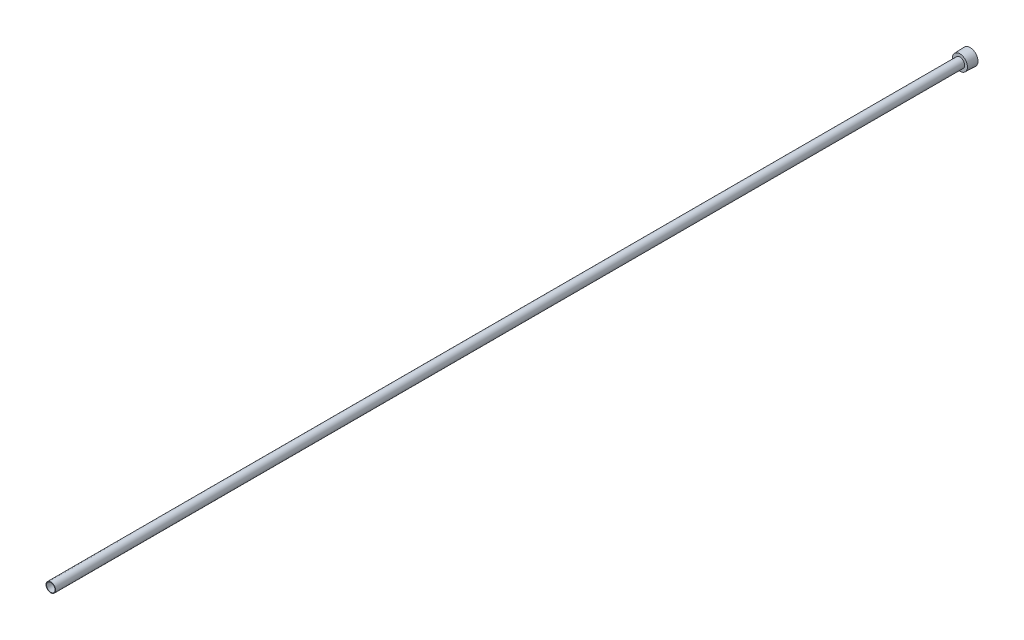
from build123d import *

# Parameters (mm, degrees)
SKETCH2_R          = 5.6388
CUT_EXTRUDE1_DEPTH = 1220.291132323
CUT_EXTRUDE2_DEPTH = 9.525


with BuildPart() as part:
    # Sketch1 → Revolve1 (revolve)
    with BuildSketch(Plane(origin=(0, 0, 0), x_dir=(0, 0, -1), z_dir=(1, 0, 0)), mode=Mode.PRIVATE) as revolve1_sk:
        Polygon((0, 10.541), (-13.4874, 10.049032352), (-13.4874, 6.35), (-1219.2, 6.35), (-1219.2, 0), (0, 0), align=None)
    revolve(revolve1_sk.sketch.rotate(Axis((0, 0, 223.212151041), (0, 0, -1)), 90), axis=Axis((0, 0, 223.212151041), (0, 0, -1)))

    # Sketch2 → Cut-Extrude1 (cut, through all)
    with BuildSketch(Plane.XY.offset(1219.2)):
        Circle(SKETCH2_R)
    extrude(amount=-CUT_EXTRUDE1_DEPTH, mode=Mode.SUBTRACT)

    # Sketch3 → Cut-Extrude2 (cut)
    with BuildSketch(Plane(origin=(0, 0, 0), x_dir=(-1, 0, 0), z_dir=(0, 0, -1))):
        Polygon((0, -7.332348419), (6.35, -3.666174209), (6.35, 3.666174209), (0, 7.332348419), (-6.35, 3.666174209), (-6.35, -3.666174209), align=None)
    extrude(amount=-CUT_EXTRUDE2_DEPTH, mode=Mode.SUBTRACT)


solid = part.part
